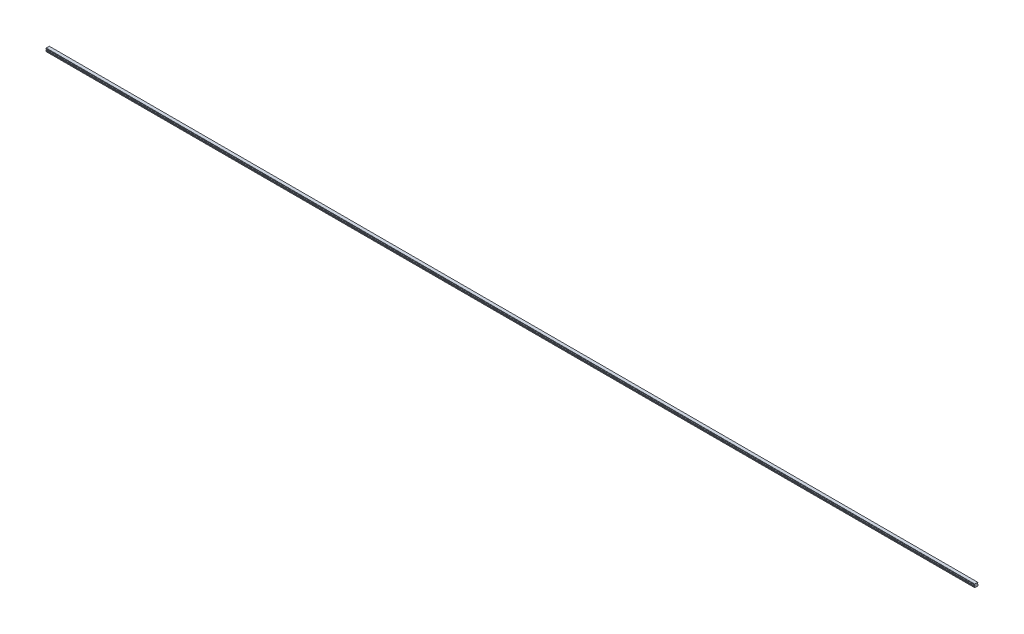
from build123d import *

# Parameters (mm, degrees)
BOSS_EXTRUDE1_DEPTH        = 3960
SKETCH3_R                  = 2.5
SKETCH3_R_2                = 2.1
CUT_EXTRUDE3_DEPTH         = 7
SKETCH3_2_R                = 2.1
CUT_EXTRUDE4_DEPTH         = 9.5
CHAMFER1_SIZE              = 0.4
LPATTERN2_COUNT            = 66
LPATTERN2_PITCH            = 60
CHAMFER1_OF_LPATTERN2_SIZE = 0.4


with BuildPart() as part:
    # Sketch1 → Boss-Extrude1 (new body)
    with BuildSketch(Plane(origin=(0, 0, 0), x_dir=(0, 0, -1), z_dir=(1, 0, 0))):
        with BuildLine():
            Line((6.59, 14), (-6.59, 14))
            Line((-6.59, 14), (-6.59, 13.15))
            Line((-6.59, 13.15), (-6.96, 12.356532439))
            Line((-6.96, 12.356532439), (-6.96, 11.435174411))
            ThreePointArc((-6.96, 11.435174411), (-5.25, 9.5), (-6.96, 7.564825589))
            Line((-6.96, 7.564825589), (-6.96, 6.643467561))
            Line((-6.96, 6.643467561), (-6.59, 5.85))
            Line((-6.59, 5.85), (-7.032116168, 4.2))
            Line((-7.032116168, 4.2), (-7.5, 3.929867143))
            Line((-7.5, 3.929867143), (-7.5, 1.4))
            Line((-7.5, 1.4), (-6.1, 0))
            Line((-6.1, 0), (-3.65, 0))
            Line((-3.65, 0), (-3.25, 0.4))
            Line((-3.25, 0.4), (3.25, 0.4))
            Line((3.25, 0.4), (3.65, 0))
            Line((3.65, 0), (6.1, 0))
            Line((6.1, 0), (7.5, 1.4))
            Line((7.5, 1.4), (7.5, 3.929867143))
            Line((7.5, 3.929867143), (7.032116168, 4.2))
            Line((7.032116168, 4.2), (6.59, 5.85))
            Line((6.59, 5.85), (6.96, 6.643467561))
            Line((6.96, 6.643467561), (6.96, 7.564825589))
            ThreePointArc((6.96, 7.564825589), (5.25, 9.5), (6.96, 11.435174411))
            Line((6.96, 11.435174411), (6.96, 12.356532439))
            Line((6.96, 12.356532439), (6.59, 13.15))
            Line((6.59, 13.15), (6.59, 14))
        make_face()
    extrude(amount=BOSS_EXTRUDE1_DEPTH)

    # Sketch3 → Cut-Extrude3 (cut)
    with BuildSketch(Plane.XZ):
        with Locations(Location((30, 0, 0), (0, 0, 270))):
            Circle(SKETCH3_R)
        with Locations(Location((30, 0, 0), (0, 0, 270))):
            Circle(SKETCH3_R_2, mode=Mode.SUBTRACT)
    cut_extrude3 = extrude(amount=-CUT_EXTRUDE3_DEPTH, mode=Mode.SUBTRACT)

    # Sketch3_2 → Cut-Extrude4 (cut)
    with BuildSketch(Plane.XZ):
        with Locations(Location((30, 0, 0), (0, 0, 270))):
            Circle(SKETCH3_2_R)
    cut_extrude4 = extrude(amount=-CUT_EXTRUDE4_DEPTH, mode=Mode.SUBTRACT)

    # Cut-Extrude5 cone 1 section (on through the dimple's axis) → Cut-Extrude5 (revolve, cut)
    with BuildSketch(Plane(origin=(30, 9.5, 0), x_dir=(0, 0, -1), z_dir=(1, 0, 0))):
        Polygon((0, 0), (2.1, 0), (0, 1.212435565), align=None)
    revolve(axis=Axis((30, 9.5, 0), (0, 1, 0)), mode=Mode.SUBTRACT)

    # Chamfer1
    chamfer1_edges = [part.edges().sort_by_distance(p)[0] for p in [
        (30, 0.4, 2.5),
    ]]
    chamfer(chamfer1_edges, length=CHAMFER1_SIZE)

    # LPattern2: Cut-Extrude3, Cut-Extrude4 ×66
    with Locations(*[(i * LPATTERN2_PITCH, 0, 0) for i in range(1, LPATTERN2_COUNT)]):
        add(cut_extrude3, mode=Mode.SUBTRACT)
        add(cut_extrude4, mode=Mode.SUBTRACT)

    # Chamfer1 of LPattern2
    chamfer1_of_lpattern2_edges = [part.edges().sort_by_distance(p)[0] for p in [
        (90, 0.4, 2.5),
        (150, 0.4, 2.5),
        (210, 0.4, 2.5),
        (270, 0.4, 2.5),
        (330, 0.4, 2.5),
        (390, 0.4, 2.5),
        (450, 0.4, 2.5),
        (510, 0.4, 2.5),
        (570, 0.4, 2.5),
        (630, 0.4, 2.5),
        (690, 0.4, 2.5),
        (750, 0.4, 2.5),
        (810, 0.4, 2.5),
        (870, 0.4, 2.5),
        (930, 0.4, 2.5),
        (990, 0.4, 2.5),
        (1050, 0.4, 2.5),
        (1110, 0.4, 2.5),
        (1170, 0.4, 2.5),
        (1230, 0.4, 2.5),
        (1290, 0.4, 2.5),
        (1350, 0.4, 2.5),
        (1410, 0.4, 2.5),
        (1470, 0.4, 2.5),
        (1530, 0.4, 2.5),
        (1590, 0.4, 2.5),
        (1650, 0.4, 2.5),
        (1710, 0.4, 2.5),
        (1770, 0.4, 2.5),
        (1830, 0.4, 2.5),
        (1890, 0.4, 2.5),
        (1950, 0.4, 2.5),
        (2010, 0.4, 2.5),
        (2070, 0.4, 2.5),
        (2130, 0.4, 2.5),
        (2190, 0.4, 2.5),
        (2250, 0.4, 2.5),
        (2310, 0.4, 2.5),
        (2370, 0.4, 2.5),
        (2430, 0.4, 2.5),
        (2490, 0.4, 2.5),
        (2550, 0.4, 2.5),
        (2610, 0.4, 2.5),
        (2670, 0.4, 2.5),
        (2730, 0.4, 2.5),
        (2790, 0.4, 2.5),
        (2850, 0.4, 2.5),
        (2910, 0.4, 2.5),
        (2970, 0.4, 2.5),
        (3030, 0.4, 2.5),
        (3090, 0.4, 2.5),
        (3150, 0.4, 2.5),
        (3210, 0.4, 2.5),
        (3270, 0.4, 2.5),
        (3330, 0.4, 2.5),
        (3390, 0.4, 2.5),
        (3450, 0.4, 2.5),
        (3510, 0.4, 2.5),
        (3570, 0.4, 2.5),
        (3630, 0.4, 2.5),
        (3690, 0.4, 2.5),
        (3750, 0.4, 2.5),
        (3810, 0.4, 2.5),
        (3870, 0.4, 2.5),
        (3930, 0.4, 2.5),
    ]]
    chamfer(chamfer1_of_lpattern2_edges, length=CHAMFER1_OF_LPATTERN2_SIZE)


solid = part.part
